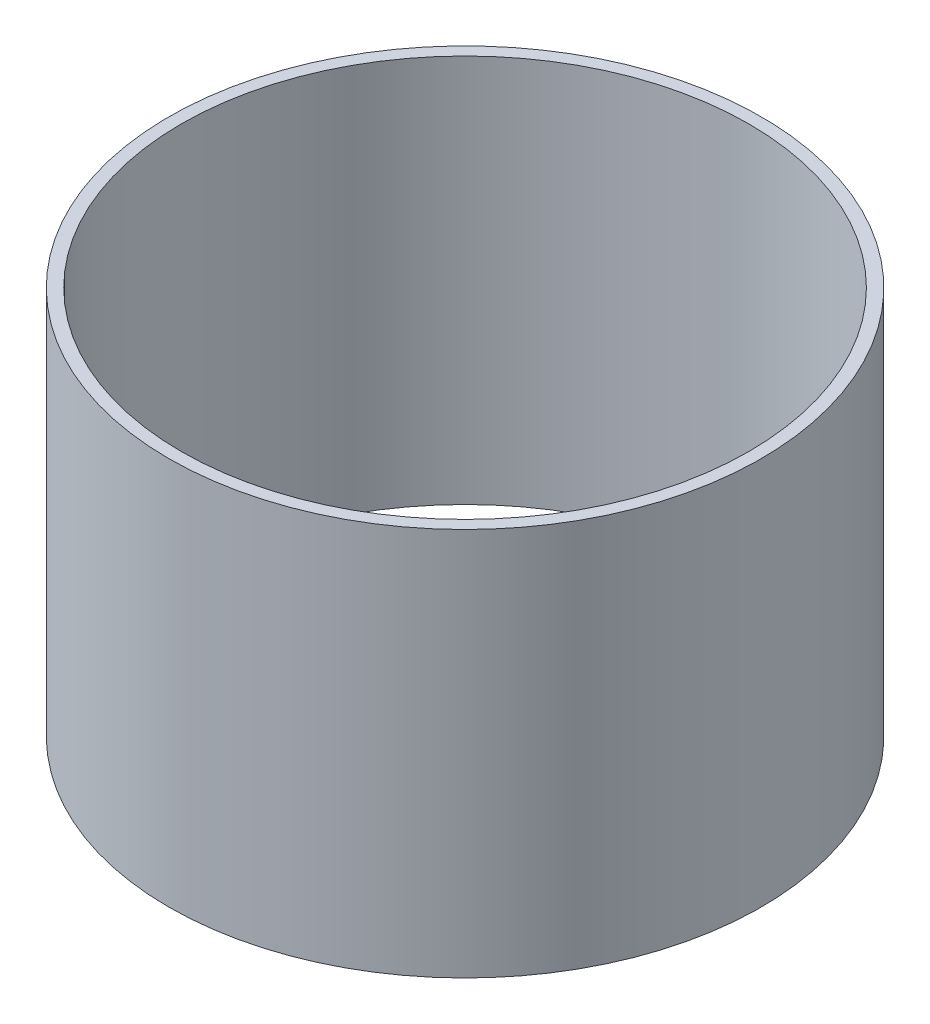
ISO-10303-21;
HEADER;
FILE_DESCRIPTION(('STEP AP214'),'2;1');
FILE_NAME('part.step','',(''),(''),'','','');
FILE_SCHEMA(('AUTOMOTIVE_DESIGN { 1 0 10303 214 1 1 1 1 }'));
ENDSEC;
DATA;
#1=APPLICATION_CONTEXT('core data for automotive mechanical design processes');
#2=APPLICATION_PROTOCOL_DEFINITION('international standard','automotive_design',2000,#1);
#3=PRODUCT_CONTEXT('',#1,'mechanical');
#4=PRODUCT('Part','Part','',(#3));
#5=PRODUCT_RELATED_PRODUCT_CATEGORY('part','',(#4));
#6=PRODUCT_DEFINITION_FORMATION('','',#4);
#7=PRODUCT_DEFINITION_CONTEXT('part definition',#1,'design');
#8=PRODUCT_DEFINITION('design','',#6,#7);
#9=PRODUCT_DEFINITION_SHAPE('','',#8);
#10=(LENGTH_UNIT() NAMED_UNIT(*) SI_UNIT(.MILLI.,.METRE.));
#11=(NAMED_UNIT(*) PLANE_ANGLE_UNIT() SI_UNIT($,.RADIAN.));
#12=(NAMED_UNIT(*) SI_UNIT($,.STERADIAN.) SOLID_ANGLE_UNIT());
#13=UNCERTAINTY_MEASURE_WITH_UNIT(LENGTH_MEASURE(1.E-05),#10,'distance_accuracy_value','');
#14=(GEOMETRIC_REPRESENTATION_CONTEXT(3) GLOBAL_UNCERTAINTY_ASSIGNED_CONTEXT((#13)) GLOBAL_UNIT_ASSIGNED_CONTEXT((#10,
#11,#12)) REPRESENTATION_CONTEXT('',''));
#15=CARTESIAN_POINT('',(0.,0.,0.));
#16=DIRECTION('',(0.,0.,1.));
#17=DIRECTION('',(1.,0.,0.));
#18=AXIS2_PLACEMENT_3D('',#15,#16,#17);
#19=CARTESIAN_POINT('',(0.,199.898,0.));
#20=DIRECTION('',(0.,1.,0.));
#21=DIRECTION('',(0.,0.,1.));
#22=AXIS2_PLACEMENT_3D('',#19,#20,#21);
#23=PLANE('',#22);
#24=CARTESIAN_POINT('',(0.,199.898,0.));
#25=DIRECTION('',(0.,1.,0.));
#26=DIRECTION('',(0.,0.,1.));
#27=AXIS2_PLACEMENT_3D('',#24,#25,#26);
#28=CIRCLE('',#27,152.4);
#29=CARTESIAN_POINT('',(0.,199.898,152.4));
#30=VERTEX_POINT('',#29);
#31=EDGE_CURVE('E10',#30,#30,#28,.T.);
#32=ORIENTED_EDGE('',*,*,#31,.T.);
#33=EDGE_LOOP('',(#32));
#34=FACE_BOUND('',#33,.T.);
#35=CARTESIAN_POINT('',(0.,199.898,0.));
#36=DIRECTION('',(0.,1.,0.));
#37=DIRECTION('',(0.,0.,1.));
#38=AXIS2_PLACEMENT_3D('',#35,#36,#37);
#39=CIRCLE('',#38,146.05);
#40=CARTESIAN_POINT('',(0.,199.898,146.05));
#41=VERTEX_POINT('',#40);
#42=EDGE_CURVE('E41',#41,#41,#39,.T.);
#43=ORIENTED_EDGE('',*,*,#42,.F.);
#44=EDGE_LOOP('',(#43));
#45=FACE_BOUND('',#44,.T.);
#46=ADVANCED_FACE('F30',(#34,#45),#23,.T.);
#47=CARTESIAN_POINT('',(0.,0.,0.));
#48=DIRECTION('',(0.,1.,0.));
#49=DIRECTION('',(0.,0.,1.));
#50=AXIS2_PLACEMENT_3D('',#47,#48,#49);
#51=PLANE('',#50);
#52=CARTESIAN_POINT('',(0.,0.,0.));
#53=DIRECTION('',(0.,1.,0.));
#54=DIRECTION('',(0.,0.,1.));
#55=AXIS2_PLACEMENT_3D('',#52,#53,#54);
#56=CIRCLE('',#55,152.4);
#57=CARTESIAN_POINT('',(0.,0.,152.4));
#58=VERTEX_POINT('',#57);
#59=EDGE_CURVE('E37',#58,#58,#56,.T.);
#60=ORIENTED_EDGE('',*,*,#59,.F.);
#61=EDGE_LOOP('',(#60));
#62=FACE_BOUND('',#61,.T.);
#63=CARTESIAN_POINT('',(0.,0.,0.));
#64=DIRECTION('',(0.,1.,0.));
#65=DIRECTION('',(0.,0.,1.));
#66=AXIS2_PLACEMENT_3D('',#63,#64,#65);
#67=CIRCLE('',#66,146.05);
#68=CARTESIAN_POINT('',(0.,0.,146.05));
#69=VERTEX_POINT('',#68);
#70=EDGE_CURVE('E45',#69,#69,#67,.T.);
#71=ORIENTED_EDGE('',*,*,#70,.T.);
#72=EDGE_LOOP('',(#71));
#73=FACE_BOUND('',#72,.T.);
#74=ADVANCED_FACE('F51',(#62,#73),#51,.F.);
#75=CARTESIAN_POINT('',(0.,199.898,0.));
#76=DIRECTION('',(0.,-1.,0.));
#77=DIRECTION('',(0.,0.,-1.));
#78=AXIS2_PLACEMENT_3D('',#75,#76,#77);
#79=CYLINDRICAL_SURFACE('',#78,152.4);
#80=ORIENTED_EDGE('',*,*,#31,.F.);
#81=EDGE_LOOP('',(#80));
#82=FACE_BOUND('',#81,.T.);
#83=ORIENTED_EDGE('',*,*,#59,.T.);
#84=EDGE_LOOP('',(#83));
#85=FACE_BOUND('',#84,.T.);
#86=ADVANCED_FACE('F32',(#82,#85),#79,.T.);
#87=CARTESIAN_POINT('',(0.,199.898,0.));
#88=DIRECTION('',(0.,-1.,0.));
#89=DIRECTION('',(0.,0.,-1.));
#90=AXIS2_PLACEMENT_3D('',#87,#88,#89);
#91=CYLINDRICAL_SURFACE('',#90,146.05);
#92=ORIENTED_EDGE('',*,*,#42,.T.);
#93=EDGE_LOOP('',(#92));
#94=FACE_BOUND('',#93,.T.);
#95=ORIENTED_EDGE('',*,*,#70,.F.);
#96=EDGE_LOOP('',(#95));
#97=FACE_BOUND('',#96,.T.);
#98=ADVANCED_FACE('F53',(#94,#97),#91,.F.);
#99=CLOSED_SHELL('',(#46,#74,#86,#98));
#100=MANIFOLD_SOLID_BREP('B2',#99);
#101=ADVANCED_BREP_SHAPE_REPRESENTATION('',(#18,#100),#14);
#102=SHAPE_DEFINITION_REPRESENTATION(#9,#101);
ENDSEC;
END-ISO-10303-21;
